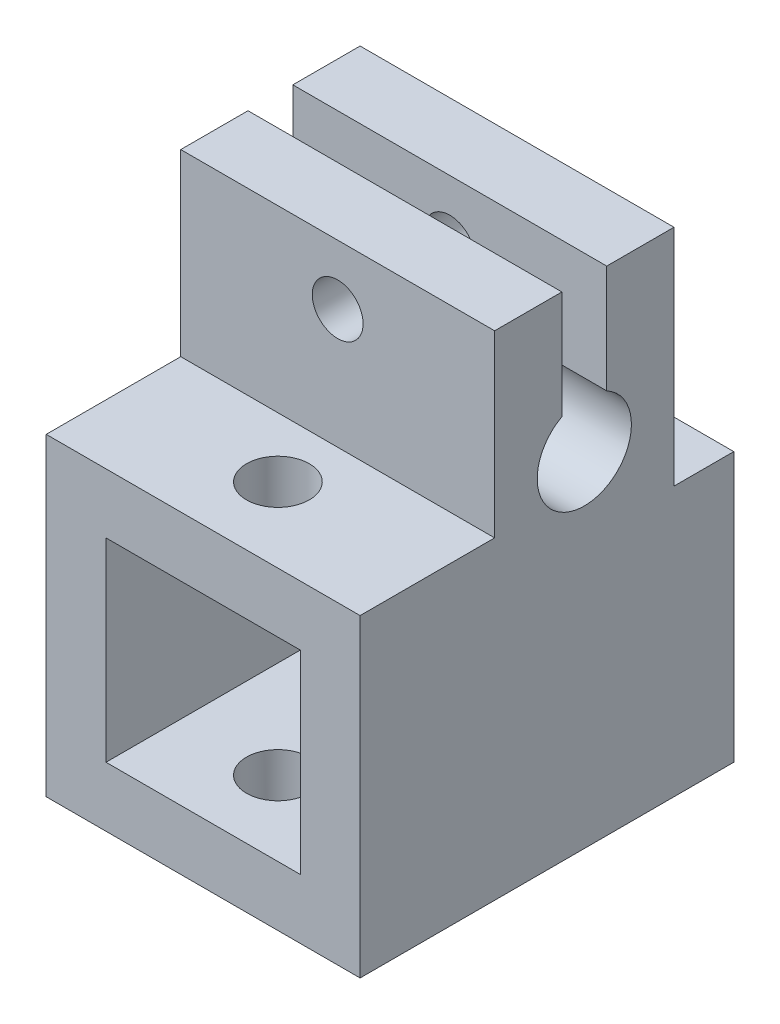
ISO-10303-21;
HEADER;
FILE_DESCRIPTION(('STEP AP214'),'2;1');
FILE_NAME('part.step','',(''),(''),'','','');
FILE_SCHEMA(('AUTOMOTIVE_DESIGN { 1 0 10303 214 1 1 1 1 }'));
ENDSEC;
DATA;
#1=APPLICATION_CONTEXT('core data for automotive mechanical design processes');
#2=APPLICATION_PROTOCOL_DEFINITION('international standard','automotive_design',2000,#1);
#3=PRODUCT_CONTEXT('',#1,'mechanical');
#4=PRODUCT('Part','Part','',(#3));
#5=PRODUCT_RELATED_PRODUCT_CATEGORY('part','',(#4));
#6=PRODUCT_DEFINITION_FORMATION('','',#4);
#7=PRODUCT_DEFINITION_CONTEXT('part definition',#1,'design');
#8=PRODUCT_DEFINITION('design','',#6,#7);
#9=PRODUCT_DEFINITION_SHAPE('','',#8);
#10=(LENGTH_UNIT() NAMED_UNIT(*) SI_UNIT(.MILLI.,.METRE.));
#11=(NAMED_UNIT(*) PLANE_ANGLE_UNIT() SI_UNIT($,.RADIAN.));
#12=(NAMED_UNIT(*) SI_UNIT($,.STERADIAN.) SOLID_ANGLE_UNIT());
#13=UNCERTAINTY_MEASURE_WITH_UNIT(LENGTH_MEASURE(1.E-05),#10,'distance_accuracy_value','');
#14=(GEOMETRIC_REPRESENTATION_CONTEXT(3) GLOBAL_UNCERTAINTY_ASSIGNED_CONTEXT((#13)) GLOBAL_UNIT_ASSIGNED_CONTEXT((#10,
#11,#12)) REPRESENTATION_CONTEXT('',''));
#15=CARTESIAN_POINT('',(0.,0.,0.));
#16=DIRECTION('',(0.,0.,1.));
#17=DIRECTION('',(1.,0.,0.));
#18=AXIS2_PLACEMENT_3D('',#15,#16,#17);
#19=CARTESIAN_POINT('',(0.,22.5,0.));
#20=DIRECTION('',(0.,1.,0.));
#21=DIRECTION('',(0.,0.,1.));
#22=AXIS2_PLACEMENT_3D('',#19,#20,#21);
#23=PLANE('',#22);
#24=DIRECTION('',(-1.,0.,0.));
#25=VECTOR('',#24,1.);
#26=CARTESIAN_POINT('',(0.,22.5,8.5));
#27=LINE('',#26,#25);
#28=CARTESIAN_POINT('',(10.5,22.5,8.5));
#29=VERTEX_POINT('',#28);
#30=CARTESIAN_POINT('',(-10.5,22.5,8.5));
#31=VERTEX_POINT('',#30);
#32=EDGE_CURVE('E272',#29,#31,#27,.T.);
#33=ORIENTED_EDGE('',*,*,#32,.F.);
#34=DIRECTION('',(0.,0.,1.));
#35=VECTOR('',#34,1.);
#36=CARTESIAN_POINT('',(10.5,22.5,4.));
#37=LINE('',#36,#35);
#38=CARTESIAN_POINT('',(10.5,22.5,4.));
#39=VERTEX_POINT('',#38);
#40=EDGE_CURVE('E190',#39,#29,#37,.T.);
#41=ORIENTED_EDGE('',*,*,#40,.F.);
#42=DIRECTION('',(1.,0.,0.));
#43=VECTOR('',#42,1.);
#44=CARTESIAN_POINT('',(7.5,22.5,4.));
#45=LINE('',#44,#43);
#46=CARTESIAN_POINT('',(-10.5,22.5,4.));
#47=VERTEX_POINT('',#46);
#48=EDGE_CURVE('E270',#47,#39,#45,.T.);
#49=ORIENTED_EDGE('',*,*,#48,.F.);
#50=DIRECTION('',(0.,0.,-1.));
#51=VECTOR('',#50,1.);
#52=CARTESIAN_POINT('',(-10.5,22.5,8.5));
#53=LINE('',#52,#51);
#54=EDGE_CURVE('E214',#31,#47,#53,.T.);
#55=ORIENTED_EDGE('',*,*,#54,.F.);
#56=EDGE_LOOP('',(#33,#41,#49,#55));
#57=FACE_BOUND('',#56,.T.);
#58=ADVANCED_FACE('F41',(#57),#23,.T.);
#59=DIRECTION('',(1.,0.,0.));
#60=VECTOR('',#59,1.);
#61=CARTESIAN_POINT('',(0.,22.5,11.5));
#62=LINE('',#61,#60);
#63=CARTESIAN_POINT('',(-10.5,22.5,11.5));
#64=VERTEX_POINT('',#63);
#65=CARTESIAN_POINT('',(10.5,22.5,11.5));
#66=VERTEX_POINT('',#65);
#67=EDGE_CURVE('E166',#64,#66,#62,.T.);
#68=ORIENTED_EDGE('',*,*,#67,.F.);
#69=DIRECTION('',(0.,0.,-1.));
#70=VECTOR('',#69,1.);
#71=CARTESIAN_POINT('',(-10.5,22.5,16.));
#72=LINE('',#71,#70);
#73=CARTESIAN_POINT('',(-10.5,22.5,16.));
#74=VERTEX_POINT('',#73);
#75=EDGE_CURVE('E235',#74,#64,#72,.T.);
#76=ORIENTED_EDGE('',*,*,#75,.F.);
#77=DIRECTION('',(-1.,0.,0.));
#78=VECTOR('',#77,1.);
#79=CARTESIAN_POINT('',(-7.5,22.5,16.));
#80=LINE('',#79,#78);
#81=CARTESIAN_POINT('',(10.5,22.5,16.));
#82=VERTEX_POINT('',#81);
#83=EDGE_CURVE('E267',#82,#74,#80,.T.);
#84=ORIENTED_EDGE('',*,*,#83,.F.);
#85=DIRECTION('',(0.,0.,1.));
#86=VECTOR('',#85,1.);
#87=CARTESIAN_POINT('',(10.5,22.5,11.5));
#88=LINE('',#87,#86);
#89=EDGE_CURVE('E202',#66,#82,#88,.T.);
#90=ORIENTED_EDGE('',*,*,#89,.F.);
#91=EDGE_LOOP('',(#68,#76,#84,#90));
#92=FACE_BOUND('',#91,.T.);
#93=ADVANCED_FACE('F338',(#92),#23,.T.);
#94=CARTESIAN_POINT('',(0.,0.,0.));
#95=DIRECTION('',(0.,0.,1.));
#96=DIRECTION('',(1.,0.,0.));
#97=AXIS2_PLACEMENT_3D('',#94,#95,#96);
#98=PLANE('',#97);
#99=DIRECTION('',(-1.,0.,0.));
#100=VECTOR('',#99,1.);
#101=CARTESIAN_POINT('',(-7.5,7.5,0.));
#102=LINE('',#101,#100);
#103=CARTESIAN_POINT('',(10.5,7.5,0.));
#104=VERTEX_POINT('',#103);
#105=CARTESIAN_POINT('',(-10.5,7.5,0.));
#106=VERTEX_POINT('',#105);
#107=EDGE_CURVE('E157',#104,#106,#102,.T.);
#108=ORIENTED_EDGE('',*,*,#107,.F.);
#109=DIRECTION('',(0.,1.,0.));
#110=VECTOR('',#109,1.);
#111=CARTESIAN_POINT('',(10.5,-10.5,0.));
#112=LINE('',#111,#110);
#113=CARTESIAN_POINT('',(10.5,-10.5,0.));
#114=VERTEX_POINT('',#113);
#115=EDGE_CURVE('E160',#114,#104,#112,.T.);
#116=ORIENTED_EDGE('',*,*,#115,.F.);
#117=DIRECTION('',(1.,0.,0.));
#118=VECTOR('',#117,1.);
#119=CARTESIAN_POINT('',(-7.5,-10.5,0.));
#120=LINE('',#119,#118);
#121=CARTESIAN_POINT('',(-10.5,-10.5,0.));
#122=VERTEX_POINT('',#121);
#123=EDGE_CURVE('E247',#122,#114,#120,.T.);
#124=ORIENTED_EDGE('',*,*,#123,.F.);
#125=DIRECTION('',(0.,-1.,0.));
#126=VECTOR('',#125,1.);
#127=CARTESIAN_POINT('',(-10.5,7.5,0.));
#128=LINE('',#127,#126);
#129=EDGE_CURVE('E162',#106,#122,#128,.T.);
#130=ORIENTED_EDGE('',*,*,#129,.F.);
#131=EDGE_LOOP('',(#108,#116,#124,#130));
#132=FACE_BOUND('',#131,.T.);
#133=ADVANCED_FACE('F43',(#132),#98,.F.);
#134=CARTESIAN_POINT('',(0.,0.,25.));
#135=DIRECTION('',(0.,0.,1.));
#136=DIRECTION('',(1.,0.,0.));
#137=AXIS2_PLACEMENT_3D('',#134,#135,#136);
#138=PLANE('',#137);
#139=DIRECTION('',(0.,1.,0.));
#140=VECTOR('',#139,1.);
#141=CARTESIAN_POINT('',(6.5,6.5,25.));
#142=LINE('',#141,#140);
#143=CARTESIAN_POINT('',(6.5,-6.5,25.));
#144=VERTEX_POINT('',#143);
#145=CARTESIAN_POINT('',(6.5,6.5,25.));
#146=VERTEX_POINT('',#145);
#147=EDGE_CURVE('E57',#144,#146,#142,.T.);
#148=ORIENTED_EDGE('',*,*,#147,.F.);
#149=DIRECTION('',(1.,0.,0.));
#150=VECTOR('',#149,1.);
#151=CARTESIAN_POINT('',(-6.5,-6.5,25.));
#152=LINE('',#151,#150);
#153=CARTESIAN_POINT('',(-6.5,-6.5,25.));
#154=VERTEX_POINT('',#153);
#155=EDGE_CURVE('E279',#154,#144,#152,.T.);
#156=ORIENTED_EDGE('',*,*,#155,.F.);
#157=DIRECTION('',(0.,-1.,0.));
#158=VECTOR('',#157,1.);
#159=CARTESIAN_POINT('',(-6.5,6.5,25.));
#160=LINE('',#159,#158);
#161=CARTESIAN_POINT('',(-6.5,6.5,25.));
#162=VERTEX_POINT('',#161);
#163=EDGE_CURVE('E292',#162,#154,#160,.T.);
#164=ORIENTED_EDGE('',*,*,#163,.F.);
#165=DIRECTION('',(-1.,0.,0.));
#166=VECTOR('',#165,1.);
#167=CARTESIAN_POINT('',(-6.5,6.5,25.));
#168=LINE('',#167,#166);
#169=EDGE_CURVE('E289',#146,#162,#168,.T.);
#170=ORIENTED_EDGE('',*,*,#169,.F.);
#171=EDGE_LOOP('',(#148,#156,#164,#170));
#172=FACE_BOUND('',#171,.T.);
#173=DIRECTION('',(-1.,0.,0.));
#174=VECTOR('',#173,1.);
#175=CARTESIAN_POINT('',(-7.5,-10.5,25.));
#176=LINE('',#175,#174);
#177=CARTESIAN_POINT('',(10.5,-10.5,25.));
#178=VERTEX_POINT('',#177);
#179=CARTESIAN_POINT('',(-10.5,-10.5,25.));
#180=VERTEX_POINT('',#179);
#181=EDGE_CURVE('E249',#178,#180,#176,.T.);
#182=ORIENTED_EDGE('',*,*,#181,.F.);
#183=DIRECTION('',(0.,-1.,0.));
#184=VECTOR('',#183,1.);
#185=CARTESIAN_POINT('',(10.5,10.5,25.));
#186=LINE('',#185,#184);
#187=CARTESIAN_POINT('',(10.5,10.5,25.));
#188=VERTEX_POINT('',#187);
#189=EDGE_CURVE('E211',#188,#178,#186,.T.);
#190=ORIENTED_EDGE('',*,*,#189,.F.);
#191=DIRECTION('',(1.,0.,0.));
#192=VECTOR('',#191,1.);
#193=CARTESIAN_POINT('',(-7.5,10.5,25.));
#194=LINE('',#193,#192);
#195=CARTESIAN_POINT('',(-10.5,10.5,25.));
#196=VERTEX_POINT('',#195);
#197=EDGE_CURVE('E251',#196,#188,#194,.T.);
#198=ORIENTED_EDGE('',*,*,#197,.F.);
#199=DIRECTION('',(0.,1.,0.));
#200=VECTOR('',#199,1.);
#201=CARTESIAN_POINT('',(-10.5,-10.5,25.));
#202=LINE('',#201,#200);
#203=EDGE_CURVE('E226',#180,#196,#202,.T.);
#204=ORIENTED_EDGE('',*,*,#203,.F.);
#205=EDGE_LOOP('',(#182,#190,#198,#204));
#206=FACE_BOUND('',#205,.T.);
#207=ADVANCED_FACE('F325',(#172,#206),#138,.T.);
#208=CARTESIAN_POINT('',(6.5,6.5,5.));
#209=DIRECTION('',(1.,0.,0.));
#210=DIRECTION('',(0.,1.,0.));
#211=AXIS2_PLACEMENT_3D('',#208,#209,#210);
#212=PLANE('',#211);
#213=ORIENTED_EDGE('',*,*,#147,.T.);
#214=DIRECTION('',(0.,0.,1.));
#215=VECTOR('',#214,1.);
#216=CARTESIAN_POINT('',(6.5,6.5,5.));
#217=LINE('',#216,#215);
#218=CARTESIAN_POINT('',(6.5,6.5,5.));
#219=VERTEX_POINT('',#218);
#220=EDGE_CURVE('E81',#219,#146,#217,.T.);
#221=ORIENTED_EDGE('',*,*,#220,.F.);
#222=DIRECTION('',(0.,1.,0.));
#223=VECTOR('',#222,1.);
#224=CARTESIAN_POINT('',(6.5,6.5,5.));
#225=LINE('',#224,#223);
#226=CARTESIAN_POINT('',(6.5,-6.5,5.));
#227=VERTEX_POINT('',#226);
#228=EDGE_CURVE('E275',#227,#219,#225,.T.);
#229=ORIENTED_EDGE('',*,*,#228,.F.);
#230=DIRECTION('',(0.,0.,1.));
#231=VECTOR('',#230,1.);
#232=CARTESIAN_POINT('',(6.5,-6.5,5.));
#233=LINE('',#232,#231);
#234=EDGE_CURVE('E65',#227,#144,#233,.T.);
#235=ORIENTED_EDGE('',*,*,#234,.T.);
#236=EDGE_LOOP('',(#213,#221,#229,#235));
#237=FACE_BOUND('',#236,.T.);
#238=ADVANCED_FACE('F370',(#237),#212,.F.);
#239=CARTESIAN_POINT('',(-6.5,-6.5,5.));
#240=DIRECTION('',(0.,-1.,0.));
#241=DIRECTION('',(0.,0.,-1.));
#242=AXIS2_PLACEMENT_3D('',#239,#240,#241);
#243=PLANE('',#242);
#244=CARTESIAN_POINT('',(0.,-6.5,20.));
#245=DIRECTION('',(0.,-1.,0.));
#246=DIRECTION('',(0.,0.,-1.));
#247=AXIS2_PLACEMENT_3D('',#244,#245,#246);
#248=CIRCLE('',#247,2.1);
#249=CARTESIAN_POINT('',(0.,-6.5,17.9));
#250=VERTEX_POINT('',#249);
#251=EDGE_CURVE('E185',#250,#250,#248,.T.);
#252=ORIENTED_EDGE('',*,*,#251,.T.);
#253=EDGE_LOOP('',(#252));
#254=FACE_BOUND('',#253,.T.);
#255=ORIENTED_EDGE('',*,*,#155,.T.);
#256=ORIENTED_EDGE('',*,*,#234,.F.);
#257=DIRECTION('',(1.,0.,0.));
#258=VECTOR('',#257,1.);
#259=CARTESIAN_POINT('',(-6.5,-6.5,5.));
#260=LINE('',#259,#258);
#261=CARTESIAN_POINT('',(-6.5,-6.5,5.));
#262=VERTEX_POINT('',#261);
#263=EDGE_CURVE('E285',#262,#227,#260,.T.);
#264=ORIENTED_EDGE('',*,*,#263,.F.);
#265=DIRECTION('',(0.,0.,1.));
#266=VECTOR('',#265,1.);
#267=CARTESIAN_POINT('',(-6.5,-6.5,5.));
#268=LINE('',#267,#266);
#269=EDGE_CURVE('E297',#262,#154,#268,.T.);
#270=ORIENTED_EDGE('',*,*,#269,.T.);
#271=EDGE_LOOP('',(#255,#256,#264,#270));
#272=FACE_BOUND('',#271,.T.);
#273=ADVANCED_FACE('F366',(#254,#272),#243,.F.);
#274=CARTESIAN_POINT('',(-6.5,6.5,5.));
#275=DIRECTION('',(-1.,0.,0.));
#276=DIRECTION('',(0.,-1.,0.));
#277=AXIS2_PLACEMENT_3D('',#274,#275,#276);
#278=PLANE('',#277);
#279=ORIENTED_EDGE('',*,*,#163,.T.);
#280=ORIENTED_EDGE('',*,*,#269,.F.);
#281=DIRECTION('',(0.,-1.,0.));
#282=VECTOR('',#281,1.);
#283=CARTESIAN_POINT('',(-6.5,6.5,5.));
#284=LINE('',#283,#282);
#285=CARTESIAN_POINT('',(-6.5,6.5,5.));
#286=VERTEX_POINT('',#285);
#287=EDGE_CURVE('E282',#286,#262,#284,.T.);
#288=ORIENTED_EDGE('',*,*,#287,.F.);
#289=DIRECTION('',(0.,0.,1.));
#290=VECTOR('',#289,1.);
#291=CARTESIAN_POINT('',(-6.5,6.5,5.));
#292=LINE('',#291,#290);
#293=EDGE_CURVE('E299',#286,#162,#292,.T.);
#294=ORIENTED_EDGE('',*,*,#293,.T.);
#295=EDGE_LOOP('',(#279,#280,#288,#294));
#296=FACE_BOUND('',#295,.T.);
#297=ADVANCED_FACE('F369',(#296),#278,.F.);
#298=CARTESIAN_POINT('',(-6.5,6.5,5.));
#299=DIRECTION('',(0.,1.,0.));
#300=DIRECTION('',(0.,0.,1.));
#301=AXIS2_PLACEMENT_3D('',#298,#299,#300);
#302=PLANE('',#301);
#303=CARTESIAN_POINT('',(0.,6.5,20.));
#304=DIRECTION('',(0.,1.,0.));
#305=DIRECTION('',(0.,0.,1.));
#306=AXIS2_PLACEMENT_3D('',#303,#304,#305);
#307=CIRCLE('',#306,2.1);
#308=CARTESIAN_POINT('',(0.,6.5,22.1));
#309=VERTEX_POINT('',#308);
#310=EDGE_CURVE('E182',#309,#309,#307,.T.);
#311=ORIENTED_EDGE('',*,*,#310,.T.);
#312=EDGE_LOOP('',(#311));
#313=FACE_BOUND('',#312,.T.);
#314=ORIENTED_EDGE('',*,*,#169,.T.);
#315=ORIENTED_EDGE('',*,*,#293,.F.);
#316=DIRECTION('',(-1.,0.,0.));
#317=VECTOR('',#316,1.);
#318=CARTESIAN_POINT('',(-6.5,6.5,5.));
#319=LINE('',#318,#317);
#320=EDGE_CURVE('E278',#219,#286,#319,.T.);
#321=ORIENTED_EDGE('',*,*,#320,.F.);
#322=ORIENTED_EDGE('',*,*,#220,.T.);
#323=EDGE_LOOP('',(#314,#315,#321,#322));
#324=FACE_BOUND('',#323,.T.);
#325=ADVANCED_FACE('F364',(#313,#324),#302,.F.);
#326=CARTESIAN_POINT('',(0.,0.,5.));
#327=DIRECTION('',(0.,0.,1.));
#328=DIRECTION('',(1.,0.,0.));
#329=AXIS2_PLACEMENT_3D('',#326,#327,#328);
#330=PLANE('',#329);
#331=ORIENTED_EDGE('',*,*,#228,.T.);
#332=ORIENTED_EDGE('',*,*,#320,.T.);
#333=ORIENTED_EDGE('',*,*,#287,.T.);
#334=ORIENTED_EDGE('',*,*,#263,.T.);
#335=EDGE_LOOP('',(#331,#332,#333,#334));
#336=FACE_BOUND('',#335,.T.);
#337=ADVANCED_FACE('F361',(#336),#330,.T.);
#338=CARTESIAN_POINT('',(-7.5,12.5,10.));
#339=DIRECTION('',(1.,0.,0.));
#340=DIRECTION('',(0.,1.,0.));
#341=AXIS2_PLACEMENT_3D('',#338,#339,#340);
#342=CYLINDRICAL_SURFACE('',#341,3.15);
#343=DIRECTION('',(1.,0.,0.));
#344=VECTOR('',#343,1.);
#345=CARTESIAN_POINT('',(-7.5,15.2699277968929,8.5));
#346=LINE('',#345,#344);
#347=CARTESIAN_POINT('',(10.5,15.2699277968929,8.5));
#348=VERTEX_POINT('',#347);
#349=CARTESIAN_POINT('',(-10.5,15.2699277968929,8.5));
#350=VERTEX_POINT('',#349);
#351=EDGE_CURVE('E50',#348,#350,#346,.F.);
#352=ORIENTED_EDGE('',*,*,#351,.T.);
#353=CARTESIAN_POINT('',(-10.5,12.5,10.));
#354=DIRECTION('',(1.,0.,0.));
#355=DIRECTION('',(0.,-1.,0.));
#356=AXIS2_PLACEMENT_3D('',#353,#354,#355);
#357=CIRCLE('',#356,3.15);
#358=CARTESIAN_POINT('',(-10.5,15.2699277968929,11.5));
#359=VERTEX_POINT('',#358);
#360=EDGE_CURVE('E241',#359,#350,#357,.T.);
#361=ORIENTED_EDGE('',*,*,#360,.F.);
#362=DIRECTION('',(1.,0.,0.));
#363=VECTOR('',#362,1.);
#364=CARTESIAN_POINT('',(-7.5,15.2699277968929,11.5));
#365=LINE('',#364,#363);
#366=CARTESIAN_POINT('',(10.5,15.2699277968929,11.5));
#367=VERTEX_POINT('',#366);
#368=EDGE_CURVE('E11',#359,#367,#365,.T.);
#369=ORIENTED_EDGE('',*,*,#368,.T.);
#370=CARTESIAN_POINT('',(10.5,12.5,10.));
#371=DIRECTION('',(-1.,0.,0.));
#372=DIRECTION('',(0.,1.,0.));
#373=AXIS2_PLACEMENT_3D('',#370,#371,#372);
#374=CIRCLE('',#373,3.15);
#375=EDGE_CURVE('E196',#348,#367,#374,.T.);
#376=ORIENTED_EDGE('',*,*,#375,.F.);
#377=EDGE_LOOP('',(#352,#361,#369,#376));
#378=FACE_BOUND('',#377,.T.);
#379=ADVANCED_FACE('F305',(#378),#342,.F.);
#380=CARTESIAN_POINT('',(0.,7.5,0.));
#381=DIRECTION('',(0.,1.,0.));
#382=DIRECTION('',(0.,0.,1.));
#383=AXIS2_PLACEMENT_3D('',#380,#381,#382);
#384=PLANE('',#383);
#385=ORIENTED_EDGE('',*,*,#107,.T.);
#386=DIRECTION('',(0.,0.,-1.));
#387=VECTOR('',#386,1.);
#388=CARTESIAN_POINT('',(-10.5,7.5,4.));
#389=LINE('',#388,#387);
#390=CARTESIAN_POINT('',(-10.5,7.5,4.));
#391=VERTEX_POINT('',#390);
#392=EDGE_CURVE('E220',#391,#106,#389,.T.);
#393=ORIENTED_EDGE('',*,*,#392,.F.);
#394=DIRECTION('',(-1.,0.,0.));
#395=VECTOR('',#394,1.);
#396=CARTESIAN_POINT('',(7.5,7.5,4.));
#397=LINE('',#396,#395);
#398=CARTESIAN_POINT('',(10.5,7.5,4.));
#399=VERTEX_POINT('',#398);
#400=EDGE_CURVE('E171',#399,#391,#397,.T.);
#401=ORIENTED_EDGE('',*,*,#400,.F.);
#402=DIRECTION('',(0.,0.,1.));
#403=VECTOR('',#402,1.);
#404=CARTESIAN_POINT('',(10.5,7.5,0.));
#405=LINE('',#404,#403);
#406=EDGE_CURVE('E169',#104,#399,#405,.T.);
#407=ORIENTED_EDGE('',*,*,#406,.F.);
#408=EDGE_LOOP('',(#385,#393,#401,#407));
#409=FACE_BOUND('',#408,.T.);
#410=ADVANCED_FACE('F170',(#409),#384,.T.);
#411=CARTESIAN_POINT('',(-7.50000000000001,23.2530298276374,8.5));
#412=DIRECTION('',(0.,0.,-1.));
#413=DIRECTION('',(-1.,0.,0.));
#414=AXIS2_PLACEMENT_3D('',#411,#412,#413);
#415=PLANE('',#414);
#416=CARTESIAN_POINT('',(0.,18.5,8.5));
#417=DIRECTION('',(0.,0.,-1.));
#418=DIRECTION('',(-1.,0.,0.));
#419=AXIS2_PLACEMENT_3D('',#416,#417,#418);
#420=CIRCLE('',#419,1.7);
#421=CARTESIAN_POINT('',(-1.7,18.5,8.5));
#422=VERTEX_POINT('',#421);
#423=EDGE_CURVE('E261',#422,#422,#420,.T.);
#424=ORIENTED_EDGE('',*,*,#423,.T.);
#425=EDGE_LOOP('',(#424));
#426=FACE_BOUND('',#425,.T.);
#427=ORIENTED_EDGE('',*,*,#32,.T.);
#428=DIRECTION('',(0.,1.,0.));
#429=VECTOR('',#428,1.);
#430=CARTESIAN_POINT('',(-10.5,15.2699277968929,8.5));
#431=LINE('',#430,#429);
#432=EDGE_CURVE('E244',#350,#31,#431,.T.);
#433=ORIENTED_EDGE('',*,*,#432,.F.);
#434=ORIENTED_EDGE('',*,*,#351,.F.);
#435=DIRECTION('',(0.,-1.,0.));
#436=VECTOR('',#435,1.);
#437=CARTESIAN_POINT('',(10.5,22.5,8.5));
#438=LINE('',#437,#436);
#439=EDGE_CURVE('E193',#29,#348,#438,.T.);
#440=ORIENTED_EDGE('',*,*,#439,.F.);
#441=EDGE_LOOP('',(#427,#433,#434,#440));
#442=FACE_BOUND('',#441,.T.);
#443=ADVANCED_FACE('F313',(#426,#442),#415,.F.);
#444=CARTESIAN_POINT('',(-7.50000000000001,23.2530298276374,11.5));
#445=DIRECTION('',(0.,0.,1.));
#446=DIRECTION('',(1.,0.,0.));
#447=AXIS2_PLACEMENT_3D('',#444,#445,#446);
#448=PLANE('',#447);
#449=CARTESIAN_POINT('',(0.,18.5,11.5));
#450=DIRECTION('',(0.,0.,1.));
#451=DIRECTION('',(1.,0.,0.));
#452=AXIS2_PLACEMENT_3D('',#449,#450,#451);
#453=CIRCLE('',#452,1.7);
#454=CARTESIAN_POINT('',(1.7,18.5,11.5));
#455=VERTEX_POINT('',#454);
#456=EDGE_CURVE('E264',#455,#455,#453,.T.);
#457=ORIENTED_EDGE('',*,*,#456,.T.);
#458=EDGE_LOOP('',(#457));
#459=FACE_BOUND('',#458,.T.);
#460=ORIENTED_EDGE('',*,*,#67,.T.);
#461=DIRECTION('',(0.,1.,0.));
#462=VECTOR('',#461,1.);
#463=CARTESIAN_POINT('',(10.5,15.2699277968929,11.5));
#464=LINE('',#463,#462);
#465=EDGE_CURVE('E199',#367,#66,#464,.T.);
#466=ORIENTED_EDGE('',*,*,#465,.F.);
#467=ORIENTED_EDGE('',*,*,#368,.F.);
#468=DIRECTION('',(0.,-1.,0.));
#469=VECTOR('',#468,1.);
#470=CARTESIAN_POINT('',(-10.5,22.5,11.5));
#471=LINE('',#470,#469);
#472=EDGE_CURVE('E238',#64,#359,#471,.T.);
#473=ORIENTED_EDGE('',*,*,#472,.F.);
#474=EDGE_LOOP('',(#460,#466,#467,#473));
#475=FACE_BOUND('',#474,.T.);
#476=ADVANCED_FACE('F341',(#459,#475),#448,.F.);
#477=CARTESIAN_POINT('',(0.,0.,4.));
#478=DIRECTION('',(0.,0.,-1.));
#479=DIRECTION('',(-1.,0.,0.));
#480=AXIS2_PLACEMENT_3D('',#477,#478,#479);
#481=PLANE('',#480);
#482=CARTESIAN_POINT('',(0.,18.5,4.));
#483=DIRECTION('',(0.,0.,-1.));
#484=DIRECTION('',(-1.,0.,0.));
#485=AXIS2_PLACEMENT_3D('',#482,#483,#484);
#486=CIRCLE('',#485,3.3);
#487=CARTESIAN_POINT('',(-3.3,18.5,4.));
#488=VERTEX_POINT('',#487);
#489=EDGE_CURVE('E255',#488,#488,#486,.T.);
#490=ORIENTED_EDGE('',*,*,#489,.F.);
#491=EDGE_LOOP('',(#490));
#492=FACE_BOUND('',#491,.T.);
#493=ORIENTED_EDGE('',*,*,#48,.T.);
#494=DIRECTION('',(0.,1.,0.));
#495=VECTOR('',#494,1.);
#496=CARTESIAN_POINT('',(10.5,7.5,4.));
#497=LINE('',#496,#495);
#498=EDGE_CURVE('E175',#399,#39,#497,.T.);
#499=ORIENTED_EDGE('',*,*,#498,.F.);
#500=ORIENTED_EDGE('',*,*,#400,.T.);
#501=DIRECTION('',(0.,-1.,0.));
#502=VECTOR('',#501,1.);
#503=CARTESIAN_POINT('',(-10.5,22.5,4.));
#504=LINE('',#503,#502);
#505=EDGE_CURVE('E217',#47,#391,#504,.T.);
#506=ORIENTED_EDGE('',*,*,#505,.F.);
#507=EDGE_LOOP('',(#493,#499,#500,#506));
#508=FACE_BOUND('',#507,.T.);
#509=ADVANCED_FACE('F317',(#492,#508),#481,.T.);
#510=CARTESIAN_POINT('',(0.,0.,16.));
#511=DIRECTION('',(0.,0.,1.));
#512=DIRECTION('',(1.,0.,0.));
#513=AXIS2_PLACEMENT_3D('',#510,#511,#512);
#514=PLANE('',#513);
#515=DIRECTION('',(-1.,0.,0.));
#516=VECTOR('',#515,1.);
#517=CARTESIAN_POINT('',(-7.5,10.5,16.));
#518=LINE('',#517,#516);
#519=CARTESIAN_POINT('',(10.5,10.5,16.));
#520=VERTEX_POINT('',#519);
#521=CARTESIAN_POINT('',(-10.5,10.5,16.));
#522=VERTEX_POINT('',#521);
#523=EDGE_CURVE('E253',#520,#522,#518,.T.);
#524=ORIENTED_EDGE('',*,*,#523,.F.);
#525=DIRECTION('',(0.,-1.,0.));
#526=VECTOR('',#525,1.);
#527=CARTESIAN_POINT('',(10.5,22.5,16.));
#528=LINE('',#527,#526);
#529=EDGE_CURVE('E205',#82,#520,#528,.T.);
#530=ORIENTED_EDGE('',*,*,#529,.F.);
#531=ORIENTED_EDGE('',*,*,#83,.T.);
#532=DIRECTION('',(0.,1.,0.));
#533=VECTOR('',#532,1.);
#534=CARTESIAN_POINT('',(-10.5,10.5,16.));
#535=LINE('',#534,#533);
#536=EDGE_CURVE('E232',#522,#74,#535,.T.);
#537=ORIENTED_EDGE('',*,*,#536,.F.);
#538=EDGE_LOOP('',(#524,#530,#531,#537));
#539=FACE_BOUND('',#538,.T.);
#540=CARTESIAN_POINT('',(0.,18.5,16.));
#541=DIRECTION('',(0.,0.,1.));
#542=DIRECTION('',(1.,0.,0.));
#543=AXIS2_PLACEMENT_3D('',#540,#541,#542);
#544=CIRCLE('',#543,1.7);
#545=CARTESIAN_POINT('',(1.7,18.5,16.));
#546=VERTEX_POINT('',#545);
#547=EDGE_CURVE('E45',#546,#546,#544,.T.);
#548=ORIENTED_EDGE('',*,*,#547,.F.);
#549=EDGE_LOOP('',(#548));
#550=FACE_BOUND('',#549,.T.);
#551=ADVANCED_FACE('F334',(#539,#550),#514,.T.);
#552=CARTESIAN_POINT('',(0.,18.5,4.));
#553=DIRECTION('',(0.,0.,-1.));
#554=DIRECTION('',(-1.,0.,0.));
#555=AXIS2_PLACEMENT_3D('',#552,#553,#554);
#556=CYLINDRICAL_SURFACE('',#555,1.7);
#557=ORIENTED_EDGE('',*,*,#547,.T.);
#558=EDGE_LOOP('',(#557));
#559=FACE_BOUND('',#558,.T.);
#560=ORIENTED_EDGE('',*,*,#456,.F.);
#561=EDGE_LOOP('',(#560));
#562=FACE_BOUND('',#561,.T.);
#563=ADVANCED_FACE('F436',(#559,#562),#556,.F.);
#564=CARTESIAN_POINT('',(0.,18.5,5.6));
#565=DIRECTION('',(0.,0.,-1.));
#566=DIRECTION('',(-1.,0.,0.));
#567=AXIS2_PLACEMENT_3D('',#564,#565,#566);
#568=CIRCLE('',#567,1.7);
#569=CARTESIAN_POINT('',(-1.7,18.5,5.6));
#570=VERTEX_POINT('',#569);
#571=EDGE_CURVE('E258',#570,#570,#568,.T.);
#572=ORIENTED_EDGE('',*,*,#571,.T.);
#573=EDGE_LOOP('',(#572));
#574=FACE_BOUND('',#573,.T.);
#575=ORIENTED_EDGE('',*,*,#423,.F.);
#576=EDGE_LOOP('',(#575));
#577=FACE_BOUND('',#576,.T.);
#578=ADVANCED_FACE('F423',(#574,#577),#556,.F.);
#579=CARTESIAN_POINT('',(0.,18.5,4.));
#580=DIRECTION('',(0.,0.,-1.));
#581=DIRECTION('',(-1.,0.,0.));
#582=AXIS2_PLACEMENT_3D('',#579,#580,#581);
#583=CONICAL_SURFACE('',#582,3.3,0.785398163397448);
#584=ORIENTED_EDGE('',*,*,#571,.F.);
#585=EDGE_LOOP('',(#584));
#586=FACE_BOUND('',#585,.T.);
#587=ORIENTED_EDGE('',*,*,#489,.T.);
#588=EDGE_LOOP('',(#587));
#589=FACE_BOUND('',#588,.T.);
#590=ADVANCED_FACE('F418',(#586,#589),#583,.F.);
#591=CARTESIAN_POINT('',(0.,10.5,0.));
#592=DIRECTION('',(0.,1.,0.));
#593=DIRECTION('',(0.,0.,1.));
#594=AXIS2_PLACEMENT_3D('',#591,#592,#593);
#595=PLANE('',#594);
#596=CARTESIAN_POINT('',(0.,10.5,20.));
#597=DIRECTION('',(0.,1.,0.));
#598=DIRECTION('',(0.,0.,1.));
#599=AXIS2_PLACEMENT_3D('',#596,#597,#598);
#600=CIRCLE('',#599,2.1);
#601=CARTESIAN_POINT('',(0.,10.5,22.1));
#602=VERTEX_POINT('',#601);
#603=EDGE_CURVE('E705',#602,#602,#600,.T.);
#604=ORIENTED_EDGE('',*,*,#603,.F.);
#605=EDGE_LOOP('',(#604));
#606=FACE_BOUND('',#605,.T.);
#607=ORIENTED_EDGE('',*,*,#523,.T.);
#608=DIRECTION('',(0.,0.,-1.));
#609=VECTOR('',#608,1.);
#610=CARTESIAN_POINT('',(-10.5,10.5,25.));
#611=LINE('',#610,#609);
#612=EDGE_CURVE('E229',#196,#522,#611,.T.);
#613=ORIENTED_EDGE('',*,*,#612,.F.);
#614=ORIENTED_EDGE('',*,*,#197,.T.);
#615=DIRECTION('',(0.,0.,1.));
#616=VECTOR('',#615,1.);
#617=CARTESIAN_POINT('',(10.5,10.5,16.));
#618=LINE('',#617,#616);
#619=EDGE_CURVE('E208',#520,#188,#618,.T.);
#620=ORIENTED_EDGE('',*,*,#619,.F.);
#621=EDGE_LOOP('',(#607,#613,#614,#620));
#622=FACE_BOUND('',#621,.T.);
#623=ADVANCED_FACE('F329',(#606,#622),#595,.T.);
#624=CARTESIAN_POINT('',(0.,-10.5,0.));
#625=DIRECTION('',(0.,-1.,0.));
#626=DIRECTION('',(0.,0.,-1.));
#627=AXIS2_PLACEMENT_3D('',#624,#625,#626);
#628=PLANE('',#627);
#629=CARTESIAN_POINT('',(0.,-10.5,20.));
#630=DIRECTION('',(0.,1.,0.));
#631=DIRECTION('',(0.,0.,1.));
#632=AXIS2_PLACEMENT_3D('',#629,#630,#631);
#633=CIRCLE('',#632,2.1);
#634=CARTESIAN_POINT('',(0.,-10.5,22.1));
#635=VERTEX_POINT('',#634);
#636=EDGE_CURVE('E707',#635,#635,#633,.T.);
#637=ORIENTED_EDGE('',*,*,#636,.T.);
#638=EDGE_LOOP('',(#637));
#639=FACE_BOUND('',#638,.T.);
#640=ORIENTED_EDGE('',*,*,#181,.T.);
#641=DIRECTION('',(0.,0.,1.));
#642=VECTOR('',#641,1.);
#643=CARTESIAN_POINT('',(-10.5,-10.5,0.));
#644=LINE('',#643,#642);
#645=EDGE_CURVE('E223',#122,#180,#644,.T.);
#646=ORIENTED_EDGE('',*,*,#645,.F.);
#647=ORIENTED_EDGE('',*,*,#123,.T.);
#648=DIRECTION('',(0.,0.,-1.));
#649=VECTOR('',#648,1.);
#650=CARTESIAN_POINT('',(10.5,-10.5,25.));
#651=LINE('',#650,#649);
#652=EDGE_CURVE('E181',#178,#114,#651,.T.);
#653=ORIENTED_EDGE('',*,*,#652,.F.);
#654=EDGE_LOOP('',(#640,#646,#647,#653));
#655=FACE_BOUND('',#654,.T.);
#656=ADVANCED_FACE('F322',(#639,#655),#628,.T.);
#657=CARTESIAN_POINT('',(-10.5,12.5,10.));
#658=DIRECTION('',(-1.,0.,0.));
#659=DIRECTION('',(0.,-1.,0.));
#660=AXIS2_PLACEMENT_3D('',#657,#658,#659);
#661=PLANE('',#660);
#662=ORIENTED_EDGE('',*,*,#54,.T.);
#663=ORIENTED_EDGE('',*,*,#505,.T.);
#664=ORIENTED_EDGE('',*,*,#392,.T.);
#665=ORIENTED_EDGE('',*,*,#129,.T.);
#666=ORIENTED_EDGE('',*,*,#645,.T.);
#667=ORIENTED_EDGE('',*,*,#203,.T.);
#668=ORIENTED_EDGE('',*,*,#612,.T.);
#669=ORIENTED_EDGE('',*,*,#536,.T.);
#670=ORIENTED_EDGE('',*,*,#75,.T.);
#671=ORIENTED_EDGE('',*,*,#472,.T.);
#672=ORIENTED_EDGE('',*,*,#360,.T.);
#673=ORIENTED_EDGE('',*,*,#432,.T.);
#674=EDGE_LOOP('',(#662,#663,#664,#665,#666,#667,#668,#669,#670,#671,#672,#673));
#675=FACE_BOUND('',#674,.T.);
#676=ADVANCED_FACE('F310',(#675),#661,.T.);
#677=CARTESIAN_POINT('',(10.5,12.5,10.));
#678=DIRECTION('',(1.,0.,0.));
#679=DIRECTION('',(0.,1.,0.));
#680=AXIS2_PLACEMENT_3D('',#677,#678,#679);
#681=PLANE('',#680);
#682=ORIENTED_EDGE('',*,*,#115,.T.);
#683=ORIENTED_EDGE('',*,*,#406,.T.);
#684=ORIENTED_EDGE('',*,*,#498,.T.);
#685=ORIENTED_EDGE('',*,*,#40,.T.);
#686=ORIENTED_EDGE('',*,*,#439,.T.);
#687=ORIENTED_EDGE('',*,*,#375,.T.);
#688=ORIENTED_EDGE('',*,*,#465,.T.);
#689=ORIENTED_EDGE('',*,*,#89,.T.);
#690=ORIENTED_EDGE('',*,*,#529,.T.);
#691=ORIENTED_EDGE('',*,*,#619,.T.);
#692=ORIENTED_EDGE('',*,*,#189,.T.);
#693=ORIENTED_EDGE('',*,*,#652,.T.);
#694=EDGE_LOOP('',(#682,#683,#684,#685,#686,#687,#688,#689,#690,#691,#692,#693));
#695=FACE_BOUND('',#694,.T.);
#696=ADVANCED_FACE('F178',(#695),#681,.T.);
#697=CARTESIAN_POINT('',(0.,10.5,20.));
#698=DIRECTION('',(0.,1.,0.));
#699=DIRECTION('',(0.,0.,1.));
#700=AXIS2_PLACEMENT_3D('',#697,#698,#699);
#701=CYLINDRICAL_SURFACE('',#700,2.1);
#702=ORIENTED_EDGE('',*,*,#636,.F.);
#703=EDGE_LOOP('',(#702));
#704=FACE_BOUND('',#703,.T.);
#705=ORIENTED_EDGE('',*,*,#251,.F.);
#706=EDGE_LOOP('',(#705));
#707=FACE_BOUND('',#706,.T.);
#708=ADVANCED_FACE('F514',(#704,#707),#701,.F.);
#709=ORIENTED_EDGE('',*,*,#603,.T.);
#710=EDGE_LOOP('',(#709));
#711=FACE_BOUND('',#710,.T.);
#712=ORIENTED_EDGE('',*,*,#310,.F.);
#713=EDGE_LOOP('',(#712));
#714=FACE_BOUND('',#713,.T.);
#715=ADVANCED_FACE('F520',(#711,#714),#701,.F.);
#716=CLOSED_SHELL('',(#58,#93,#133,#207,#238,#273,#297,#325,#337,#379,#410,#443,#476,#509,#551,
#563,#578,#590,#623,#656,#676,#696,#708,#715));
#717=MANIFOLD_SOLID_BREP('B2',#716);
#718=ADVANCED_BREP_SHAPE_REPRESENTATION('',(#18,#717),#14);
#719=SHAPE_DEFINITION_REPRESENTATION(#9,#718);
ENDSEC;
END-ISO-10303-21;
